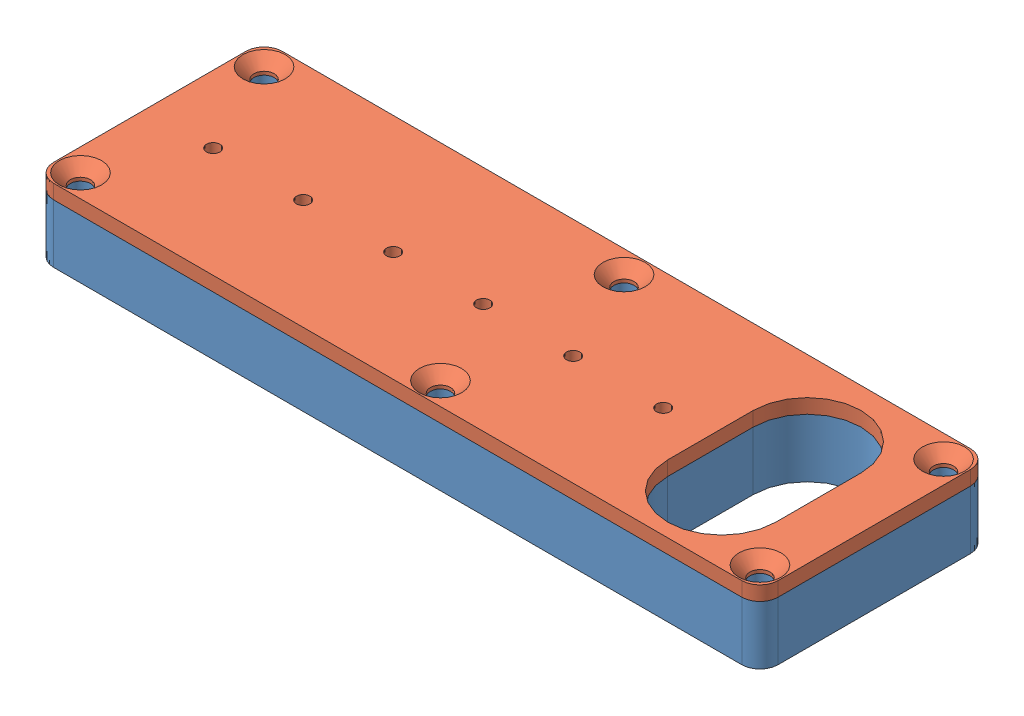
SolidWorks assembly CoverAssembly.SLDASM, configuration Default (file format 7000). Lengths in mm.
Overall size (161 16.2 50.8).
2 component instances, 2 part files, 3 mates.
Components (placement in the parent):
- Cover-1: Cover.SLDPRT [Default] at (55.0441 11.757 -24.3708) size (161 13 50.8)
- Acrylic Cover-1: Acrylic Cover.SLDPRT [Default] at (55.0441 24.757 -24.3708) x (-1 0 0) z (0 0 -1) size (161 3.2 50.8)
Mates (geometry in assembly coordinates):
- Coincident6: coincident anti-aligned: plane of Cover-1 through (55.0441 24.757 -24.3708) normal (0 1 0); plane of Acrylic Cover-1 through (55.0441 24.757 -24.3708) normal (0 -1 0)
- Coincident7: coincident aligned: plane of Cover-1 through (-105.9559 24.757 26.4292) normal (0 0 1); plane of Acrylic Cover-1 through (55.0441 27.957 26.4292) normal (0 0 1)
- Coincident8: coincident aligned: plane of Cover-1 through (55.0441 24.757 -24.3708) normal (1 0 0); plane of Acrylic Cover-1 through (55.0441 27.957 -24.3708) normal (1 0 0)
